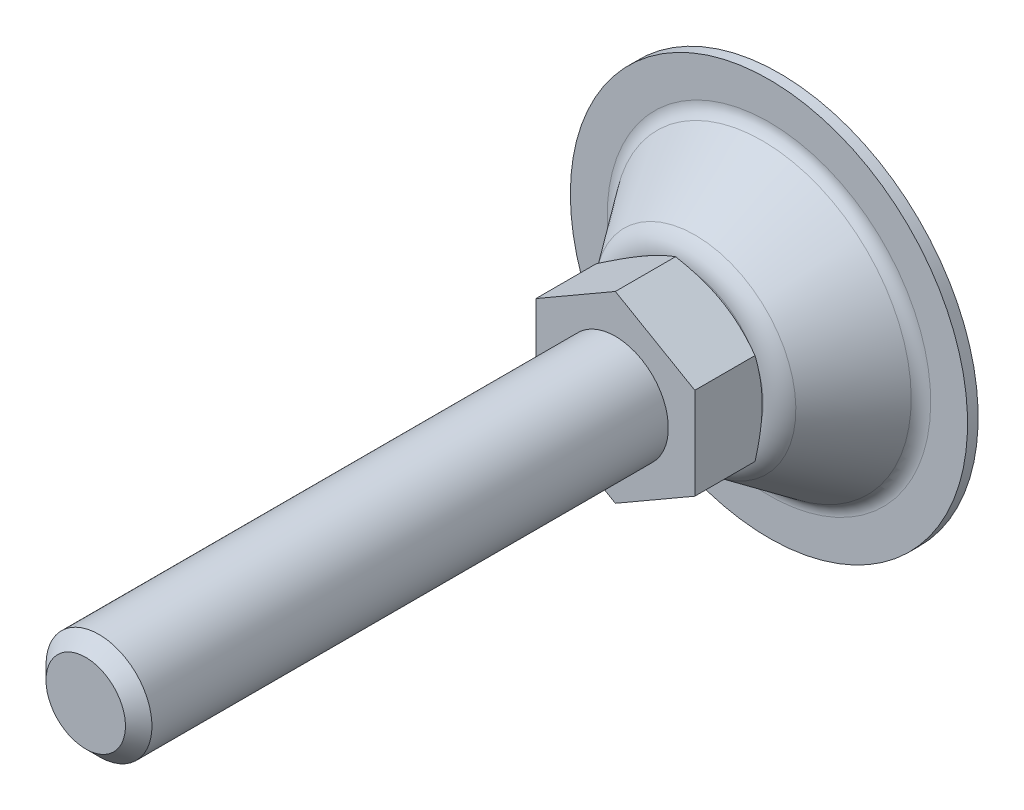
ISO-10303-21;
HEADER;
FILE_DESCRIPTION(('STEP AP214'),'2;1');
FILE_NAME('part.step','',(''),(''),'','','');
FILE_SCHEMA(('AUTOMOTIVE_DESIGN { 1 0 10303 214 1 1 1 1 }'));
ENDSEC;
DATA;
#1=APPLICATION_CONTEXT('core data for automotive mechanical design processes');
#2=APPLICATION_PROTOCOL_DEFINITION('international standard','automotive_design',2000,#1);
#3=PRODUCT_CONTEXT('',#1,'mechanical');
#4=PRODUCT('Part','Part','',(#3));
#5=PRODUCT_RELATED_PRODUCT_CATEGORY('part','',(#4));
#6=PRODUCT_DEFINITION_FORMATION('','',#4);
#7=PRODUCT_DEFINITION_CONTEXT('part definition',#1,'design');
#8=PRODUCT_DEFINITION('design','',#6,#7);
#9=PRODUCT_DEFINITION_SHAPE('','',#8);
#10=(LENGTH_UNIT() NAMED_UNIT(*) SI_UNIT(.MILLI.,.METRE.));
#11=(NAMED_UNIT(*) PLANE_ANGLE_UNIT() SI_UNIT($,.RADIAN.));
#12=(NAMED_UNIT(*) SI_UNIT($,.STERADIAN.) SOLID_ANGLE_UNIT());
#13=UNCERTAINTY_MEASURE_WITH_UNIT(LENGTH_MEASURE(1.E-05),#10,'distance_accuracy_value','');
#14=(GEOMETRIC_REPRESENTATION_CONTEXT(3) GLOBAL_UNCERTAINTY_ASSIGNED_CONTEXT((#13)) GLOBAL_UNIT_ASSIGNED_CONTEXT((#10,
#11,#12)) REPRESENTATION_CONTEXT('',''));
#15=CARTESIAN_POINT('',(0.,0.,0.));
#16=DIRECTION('',(0.,0.,1.));
#17=DIRECTION('',(1.,0.,0.));
#18=AXIS2_PLACEMENT_3D('',#15,#16,#17);
#19=CARTESIAN_POINT('',(0.,0.,31.));
#20=DIRECTION('',(0.,0.,1.));
#21=DIRECTION('',(0.5,-0.86602540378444,0.));
#22=AXIS2_PLACEMENT_3D('',#19,#20,#21);
#23=PLANE('',#22);
#24=DIRECTION('',(0.,1.,0.));
#25=VECTOR('',#24,1.);
#26=CARTESIAN_POINT('',(15.,-8.66025403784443,31.));
#27=LINE('',#26,#25);
#28=CARTESIAN_POINT('',(15.,-8.66025403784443,31.));
#29=VERTEX_POINT('',#28);
#30=CARTESIAN_POINT('',(15.,8.66025403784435,31.));
#31=VERTEX_POINT('',#30);
#32=EDGE_CURVE('E220',#29,#31,#27,.T.);
#33=ORIENTED_EDGE('',*,*,#32,.T.);
#34=DIRECTION('',(-0.866025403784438,0.5,0.));
#35=VECTOR('',#34,1.);
#36=CARTESIAN_POINT('',(15.,8.66025403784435,31.));
#37=LINE('',#36,#35);
#38=CARTESIAN_POINT('',(0.,17.3205080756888,31.));
#39=VERTEX_POINT('',#38);
#40=EDGE_CURVE('E266',#31,#39,#37,.T.);
#41=ORIENTED_EDGE('',*,*,#40,.T.);
#42=DIRECTION('',(-0.866025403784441,-0.5,0.));
#43=VECTOR('',#42,1.);
#44=CARTESIAN_POINT('',(0.,17.3205080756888,31.));
#45=LINE('',#44,#43);
#46=CARTESIAN_POINT('',(-15.,8.66025403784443,31.));
#47=VERTEX_POINT('',#46);
#48=EDGE_CURVE('E264',#39,#47,#45,.T.);
#49=ORIENTED_EDGE('',*,*,#48,.T.);
#50=DIRECTION('',(0.,-1.,0.));
#51=VECTOR('',#50,1.);
#52=CARTESIAN_POINT('',(-15.,8.66025403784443,31.));
#53=LINE('',#52,#51);
#54=CARTESIAN_POINT('',(-15.,-8.66025403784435,31.));
#55=VERTEX_POINT('',#54);
#56=EDGE_CURVE('E261',#47,#55,#53,.T.);
#57=ORIENTED_EDGE('',*,*,#56,.T.);
#58=DIRECTION('',(0.866025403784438,-0.5,0.));
#59=VECTOR('',#58,1.);
#60=CARTESIAN_POINT('',(-15.,-8.66025403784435,31.));
#61=LINE('',#60,#59);
#62=CARTESIAN_POINT('',(0.,-17.3205080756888,31.));
#63=VERTEX_POINT('',#62);
#64=EDGE_CURVE('E271',#55,#63,#61,.T.);
#65=ORIENTED_EDGE('',*,*,#64,.T.);
#66=DIRECTION('',(0.866025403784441,0.5,0.));
#67=VECTOR('',#66,1.);
#68=CARTESIAN_POINT('',(0.,-17.3205080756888,31.));
#69=LINE('',#68,#67);
#70=EDGE_CURVE('E37',#63,#29,#69,.T.);
#71=ORIENTED_EDGE('',*,*,#70,.T.);
#72=EDGE_LOOP('',(#33,#41,#49,#57,#65,#71));
#73=FACE_BOUND('',#72,.T.);
#74=CARTESIAN_POINT('',(0.,0.,31.));
#75=DIRECTION('',(0.,0.,1.));
#76=DIRECTION('',(0.5,-0.86602540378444,0.));
#77=AXIS2_PLACEMENT_3D('',#74,#75,#76);
#78=CIRCLE('',#77,10.);
#79=CARTESIAN_POINT('',(5.,-8.6602540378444,31.));
#80=VERTEX_POINT('',#79);
#81=EDGE_CURVE('E224',#80,#80,#78,.T.);
#82=ORIENTED_EDGE('',*,*,#81,.F.);
#83=EDGE_LOOP('',(#82));
#84=FACE_BOUND('',#83,.T.);
#85=ADVANCED_FACE('F14',(#73,#84),#23,.T.);
#86=CARTESIAN_POINT('',(-1.54390389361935E-13,2.67411998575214E-13,4.9999999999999));
#87=DIRECTION('',(0.,0.,1.));
#88=DIRECTION('',(0.5,-0.86602540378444,0.));
#89=AXIS2_PLACEMENT_3D('',#86,#87,#88);
#90=TOROIDAL_SURFACE('',#89,30.5382613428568,3.);
#91=CARTESIAN_POINT('',(-1.55741344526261E-13,2.69751921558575E-13,3.24909185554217));
#92=DIRECTION('',(0.,0.,1.));
#93=DIRECTION('',(0.5,-0.86602540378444,0.));
#94=AXIS2_PLACEMENT_3D('',#91,#92,#93);
#95=CIRCLE('',#94,28.1022152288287);
#96=CARTESIAN_POINT('',(14.0511076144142,-24.3372322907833,3.2490918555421));
#97=VERTEX_POINT('',#96);
#98=EDGE_CURVE('E73',#97,#97,#95,.T.);
#99=ORIENTED_EDGE('',*,*,#98,.F.);
#100=EDGE_LOOP('',(#99));
#101=FACE_BOUND('',#100,.T.);
#102=CARTESIAN_POINT('',(-1.57301461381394E-13,2.72454123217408E-13,1.99999999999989));
#103=DIRECTION('',(0.,0.,1.));
#104=DIRECTION('',(0.5,-0.86602540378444,0.));
#105=AXIS2_PLACEMENT_3D('',#102,#103,#104);
#106=CIRCLE('',#105,30.5382613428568);
#107=CARTESIAN_POINT('',(15.2691306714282,-26.446910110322,1.99999999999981));
#108=VERTEX_POINT('',#107);
#109=EDGE_CURVE('E102',#108,#108,#106,.T.);
#110=ORIENTED_EDGE('',*,*,#109,.T.);
#111=EDGE_LOOP('',(#110));
#112=FACE_BOUND('',#111,.T.);
#113=ADVANCED_FACE('F198',(#101,#112),#90,.F.);
#114=CARTESIAN_POINT('',(-1.55741344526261E-13,2.69751921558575E-13,3.24909185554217));
#115=DIRECTION('',(0.,0.,-1.));
#116=DIRECTION('',(-0.5,0.86602540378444,0.));
#117=AXIS2_PLACEMENT_3D('',#114,#115,#116);
#118=CONICAL_SURFACE('',#117,28.1022152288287,0.623199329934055);
#119=CARTESIAN_POINT('',(-1.39917641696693E-13,2.42344464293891E-13,15.9181802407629));
#120=DIRECTION('',(0.,0.,1.));
#121=DIRECTION('',(0.5,-0.86602540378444,0.));
#122=AXIS2_PLACEMENT_3D('',#119,#120,#121);
#123=CIRCLE('',#122,18.9963079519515);
#124=CARTESIAN_POINT('',(9.49815397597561,-16.4512852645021,15.9181802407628));
#125=VERTEX_POINT('',#124);
#126=EDGE_CURVE('E111',#125,#125,#123,.T.);
#127=ORIENTED_EDGE('',*,*,#126,.F.);
#128=EDGE_LOOP('',(#127));
#129=FACE_BOUND('',#128,.T.);
#130=ORIENTED_EDGE('',*,*,#98,.T.);
#131=EDGE_LOOP('',(#130));
#132=FACE_BOUND('',#131,.T.);
#133=ADVANCED_FACE('F195',(#129,#132),#118,.T.);
#134=CARTESIAN_POINT('',(-1.43982048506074E-13,2.49384223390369E-13,13.));
#135=DIRECTION('',(0.,0.,1.));
#136=DIRECTION('',(0.5,-0.86602540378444,0.));
#137=AXIS2_PLACEMENT_3D('',#134,#135,#136);
#138=TOROIDAL_SURFACE('',#137,14.9362310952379,5.);
#139=CARTESIAN_POINT('',(-1.43982048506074E-13,2.49384223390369E-13,18.));
#140=DIRECTION('',(0.,0.,1.));
#141=DIRECTION('',(0.5,-0.86602540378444,0.));
#142=AXIS2_PLACEMENT_3D('',#139,#140,#141);
#143=CIRCLE('',#142,14.9362310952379);
#144=CARTESIAN_POINT('',(7.46811554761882,-12.9351555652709,18.));
#145=VERTEX_POINT('',#144);
#146=EDGE_CURVE('E84',#145,#145,#143,.T.);
#147=ORIENTED_EDGE('',*,*,#146,.F.);
#148=EDGE_LOOP('',(#147));
#149=FACE_BOUND('',#148,.T.);
#150=ORIENTED_EDGE('',*,*,#126,.T.);
#151=EDGE_LOOP('',(#150));
#152=FACE_BOUND('',#151,.T.);
#153=ADVANCED_FACE('F191',(#149,#152),#138,.T.);
#154=CARTESIAN_POINT('',(-18.75,32.4759526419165,0.));
#155=DIRECTION('',(0.,0.,1.));
#156=DIRECTION('',(0.5,-0.86602540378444,0.));
#157=AXIS2_PLACEMENT_3D('',#154,#155,#156);
#158=PLANE('',#157);
#159=CARTESIAN_POINT('',(-1.59799463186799E-13,2.76780789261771E-13,-1.38777878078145E-13));
#160=DIRECTION('',(0.,0.,1.));
#161=DIRECTION('',(0.5,-0.86602540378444,0.));
#162=AXIS2_PLACEMENT_3D('',#159,#160,#161);
#163=CIRCLE('',#162,37.5);
#164=CARTESIAN_POINT('',(18.7499999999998,-32.4759526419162,-2.32452945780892E-13));
#165=VERTEX_POINT('',#164);
#166=EDGE_CURVE('E108',#165,#165,#163,.T.);
#167=ORIENTED_EDGE('',*,*,#166,.F.);
#168=EDGE_LOOP('',(#167));
#169=FACE_BOUND('',#168,.T.);
#170=ADVANCED_FACE('F187',(#169),#158,.F.);
#171=CARTESIAN_POINT('',(0.,0.,129.670029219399));
#172=DIRECTION('',(0.,0.,1.));
#173=DIRECTION('',(0.5,-0.86602540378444,0.));
#174=AXIS2_PLACEMENT_3D('',#171,#172,#173);
#175=CYLINDRICAL_SURFACE('',#174,37.5);
#176=CARTESIAN_POINT('',(-1.57301461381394E-13,2.72454123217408E-13,1.99999999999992));
#177=DIRECTION('',(0.,0.,1.));
#178=DIRECTION('',(0.5,-0.86602540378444,0.));
#179=AXIS2_PLACEMENT_3D('',#176,#177,#178);
#180=CIRCLE('',#179,37.5);
#181=CARTESIAN_POINT('',(18.7499999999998,-32.4759526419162,1.99999999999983));
#182=VERTEX_POINT('',#181);
#183=EDGE_CURVE('E105',#182,#182,#180,.T.);
#184=ORIENTED_EDGE('',*,*,#183,.F.);
#185=EDGE_LOOP('',(#184));
#186=FACE_BOUND('',#185,.T.);
#187=ORIENTED_EDGE('',*,*,#166,.T.);
#188=EDGE_LOOP('',(#187));
#189=FACE_BOUND('',#188,.T.);
#190=ADVANCED_FACE('F183',(#186,#189),#175,.T.);
#191=CARTESIAN_POINT('',(-18.75,32.4759526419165,2.));
#192=DIRECTION('',(0.,0.,-1.));
#193=DIRECTION('',(-0.5,0.86602540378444,0.));
#194=AXIS2_PLACEMENT_3D('',#191,#192,#193);
#195=PLANE('',#194);
#196=ORIENTED_EDGE('',*,*,#109,.F.);
#197=EDGE_LOOP('',(#196));
#198=FACE_BOUND('',#197,.T.);
#199=ORIENTED_EDGE('',*,*,#183,.T.);
#200=EDGE_LOOP('',(#199));
#201=FACE_BOUND('',#200,.T.);
#202=ADVANCED_FACE('F128',(#198,#201),#195,.F.);
#203=CARTESIAN_POINT('',(0.,0.,23.0943491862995));
#204=DIRECTION('',(0.,0.,1.));
#205=DIRECTION('',(0.5,-0.86602540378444,0.));
#206=AXIS2_PLACEMENT_3D('',#203,#204,#205);
#207=CONICAL_SURFACE('',#206,23.323671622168,1.0471975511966);
#208=CARTESIAN_POINT('',(0.,0.,18.));
#209=DIRECTION('',(0.,0.,-1.));
#210=DIRECTION('',(-0.5,0.86602540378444,0.));
#211=AXIS2_PLACEMENT_3D('',#208,#209,#210);
#212=CIRCLE('',#211,14.5);
#213=CARTESIAN_POINT('',(-7.25,12.5573683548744,18.));
#214=VERTEX_POINT('',#213);
#215=EDGE_CURVE('E226',#214,#214,#212,.T.);
#216=ORIENTED_EDGE('',*,*,#215,.F.);
#217=EDGE_LOOP('',(#216));
#218=FACE_BOUND('',#217,.T.);
#219=CARTESIAN_POINT('',(-12.7752963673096,-24.6963288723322,25.6816332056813));
#220=CARTESIAN_POINT('',(-12.4910694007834,-24.5322303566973,25.5220895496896));
#221=CARTESIAN_POINT('',(-12.206512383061,-24.3679412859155,25.3633302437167));
#222=CARTESIAN_POINT('',(-11.6366694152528,-24.0389422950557,25.0475576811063));
#223=CARTESIAN_POINT('',(-11.3513834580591,-23.8742323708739,24.8905444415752));
#224=CARTESIAN_POINT('',(-10.4942547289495,-23.3793688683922,24.4223494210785));
#225=CARTESIAN_POINT('',(-9.92122319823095,-23.0485289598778,24.1140585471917));
#226=CARTESIAN_POINT('',(-8.76831153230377,-22.3828950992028,23.5053939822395));
#227=CARTESIAN_POINT('',(-8.18841117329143,-22.0480894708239,23.2050712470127));
#228=CARTESIAN_POINT('',(-7.02404380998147,-21.3758416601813,22.6165131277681));
#229=CARTESIAN_POINT('',(-6.43957701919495,-21.0383996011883,22.3282771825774));
#230=CARTESIAN_POINT('',(-5.24579106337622,-20.3491669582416,21.7578369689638));
#231=CARTESIAN_POINT('',(-4.6362875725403,-19.9972699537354,21.4761443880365));
#232=CARTESIAN_POINT('',(-3.41019349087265,-19.2893842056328,20.9337181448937));
#233=CARTESIAN_POINT('',(-2.79360212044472,-18.9333950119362,20.6729868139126));
#234=CARTESIAN_POINT('',(-1.55348395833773,-18.2174124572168,20.1792225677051));
#235=CARTESIAN_POINT('',(-0.929973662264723,-17.8574286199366,19.9461348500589));
#236=CARTESIAN_POINT('',(0.326048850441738,-17.1322636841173,19.5150244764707));
#237=CARTESIAN_POINT('',(0.958558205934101,-16.7670842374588,19.3169909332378));
#238=CARTESIAN_POINT('',(1.91243675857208,-16.216362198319,19.0538662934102));
#239=CARTESIAN_POINT('',(2.2303543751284,-16.0328123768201,18.9719940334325));
#240=CARTESIAN_POINT('',(2.8683856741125,-15.6644448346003,18.8205188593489));
#241=CARTESIAN_POINT('',(3.18849931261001,-15.4796271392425,18.7509157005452));
#242=CARTESIAN_POINT('',(3.83071190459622,-15.1088455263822,18.6251978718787));
#243=CARTESIAN_POINT('',(4.15281082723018,-14.9228816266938,18.5690829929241));
#244=CARTESIAN_POINT('',(4.79866142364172,-14.5499996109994,18.4714557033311));
#245=CARTESIAN_POINT('',(5.12241302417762,-14.3630815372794,18.4299426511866));
#246=CARTESIAN_POINT('',(5.7668346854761,-13.9910245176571,18.3628722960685));
#247=CARTESIAN_POINT('',(6.08748870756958,-13.8058948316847,18.3371107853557));
#248=CARTESIAN_POINT('',(6.72945271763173,-13.4352567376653,18.3012764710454));
#249=CARTESIAN_POINT('',(7.05076269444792,-13.2497483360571,18.2912034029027));
#250=CARTESIAN_POINT('',(7.69346432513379,-12.878684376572,18.2869861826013));
#251=CARTESIAN_POINT('',(8.0148559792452,-12.6931288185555,18.2928420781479));
#252=CARTESIAN_POINT('',(8.65713622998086,-12.3223081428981,18.3203381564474));
#253=CARTESIAN_POINT('',(8.9780248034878,-12.1370430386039,18.3419790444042));
#254=CARTESIAN_POINT('',(9.74531187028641,-11.694049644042,18.4121345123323));
#255=CARTESIAN_POINT('',(10.1912229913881,-11.4366027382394,18.4678874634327));
#256=CARTESIAN_POINT('',(11.0798234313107,-10.9235690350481,18.6068735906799));
#257=CARTESIAN_POINT('',(11.5225123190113,-10.6679824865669,18.6901103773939));
#258=CARTESIAN_POINT('',(12.4042155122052,-10.158930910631,18.881103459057));
#259=CARTESIAN_POINT('',(12.84322676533,-9.90546764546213,18.988878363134));
#260=CARTESIAN_POINT('',(13.7168888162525,-9.40105862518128,19.2256508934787));
#261=CARTESIAN_POINT('',(14.151539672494,-9.15011283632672,19.3546482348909));
#262=CARTESIAN_POINT('',(15.0261682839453,-8.64514577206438,19.6338079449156));
#263=CARTESIAN_POINT('',(15.466047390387,-8.39118145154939,19.7843795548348));
#264=CARTESIAN_POINT('',(16.3414739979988,-7.8857536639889,20.1013827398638));
#265=CARTESIAN_POINT('',(16.7770214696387,-7.63429021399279,20.267814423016));
#266=CARTESIAN_POINT('',(17.6439961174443,-7.13374216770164,20.6138686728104));
#267=CARTESIAN_POINT('',(18.0754245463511,-6.88465684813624,20.7934870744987));
#268=CARTESIAN_POINT('',(18.9346884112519,-6.38856062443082,21.1637718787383));
#269=CARTESIAN_POINT('',(19.3625238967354,-6.14154969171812,21.3544381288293));
#270=CARTESIAN_POINT('',(20.4004383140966,-5.54230952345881,21.829942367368));
#271=CARTESIAN_POINT('',(21.0088362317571,-5.19105082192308,22.1196663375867));
#272=CARTESIAN_POINT('',(22.2202116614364,-4.49166289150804,22.7138939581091));
#273=CARTESIAN_POINT('',(22.8231887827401,-4.14353388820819,23.0183986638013));
#274=CARTESIAN_POINT('',(24.0247789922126,-3.44979545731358,23.6391170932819));
#275=CARTESIAN_POINT('',(24.6233909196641,-3.10418669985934,23.9553338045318));
#276=CARTESIAN_POINT('',(25.8168545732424,-2.41514013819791,24.5970218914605));
#277=CARTESIAN_POINT('',(26.4117063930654,-2.07170227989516,24.9224930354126));
#278=CARTESIAN_POINT('',(27.5990157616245,-1.38620889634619,25.5812970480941));
#279=CARTESIAN_POINT('',(28.1914695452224,-1.04415554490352,25.9146389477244));
#280=CARTESIAN_POINT('',(29.3737746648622,-0.36155136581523,26.5874202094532));
#281=CARTESIAN_POINT('',(29.9636259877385,-0.0210005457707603,26.9268596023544));
#282=CARTESIAN_POINT('',(31.1410545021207,0.658788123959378,27.6107079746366));
#283=CARTESIAN_POINT('',(31.728632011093,0.998026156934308,27.9551162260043));
#284=CARTESIAN_POINT('',(32.9019328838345,1.67543173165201,28.6481104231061));
#285=CARTESIAN_POINT('',(33.4876562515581,2.01359927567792,28.9966963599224));
#286=CARTESIAN_POINT('',(35.1389838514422,2.96699370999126,29.9857106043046));
#287=CARTESIAN_POINT('',(36.2027654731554,3.5811683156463,30.6301961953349));
#288=CARTESIAN_POINT('',(38.3264251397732,4.80726379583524,31.9277855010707));
#289=CARTESIAN_POINT('',(39.3863030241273,5.4191845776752,32.5808895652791));
#290=CARTESIAN_POINT('',(41.5001458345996,6.63961229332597,33.8918828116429));
#291=CARTESIAN_POINT('',(42.5541189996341,7.24812398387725,34.5497542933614));
#292=CARTESIAN_POINT('',(44.1332517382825,8.15983669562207,35.5403535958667));
#293=CARTESIAN_POINT('',(44.6593093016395,8.46355617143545,35.8711755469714));
#294=CARTESIAN_POINT('',(45.7108863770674,9.07068447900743,36.5339556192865));
#295=CARTESIAN_POINT('',(46.2364058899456,9.37409331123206,36.865913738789));
#296=CARTESIAN_POINT('',(46.7616874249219,9.67736474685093,37.1983733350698));
#297=B_SPLINE_CURVE_WITH_KNOTS('',3,(#219,#220,#221,#222,#223,#224,#225,#226,#227,#228,#229,
#230,#231,#232,#233,#234,#235,#236,#237,#238,#239,#240,#241,#242,#243,#244,#245,#246,#247,#248,
#249,#250,#251,#252,#253,#254,#255,#256,#257,#258,#259,#260,#261,#262,#263,#264,#265,#266,#267,
#268,#269,#270,#271,#272,#273,#274,#275,#276,#277,#278,#279,#280,#281,#282,#283,#284,#285,#286,
#287,#288,#289,#290,#291,#292,#293,#294,#295,#296),.UNSPECIFIED.,.F.,.F.,(4,2,2,2,2,2,2,2,2,2,2,
2,2,2,2,2,2,2,2,2,2,2,2,2,2,2,2,2,2,2,2,2,2,2,2,2,2,2,4),(0.,1.09476161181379,2.18953393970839,
4.37939496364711,6.58092776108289,8.7823582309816,11.0563262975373,13.3305469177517,
15.6001808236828,17.869108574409,18.9972925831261,20.1254540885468,21.2535981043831,
22.3816925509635,23.4948335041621,24.6079556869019,25.7210812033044,26.8342564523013,
28.3871111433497,29.9401699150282,31.4944104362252,33.0486300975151,34.6376511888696,
36.2266831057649,37.815215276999,39.4037255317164,41.6832356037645,43.9629086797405,
46.2431673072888,48.5233688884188,50.8063278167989,53.0892982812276,55.3719375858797,
57.6545720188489,61.8159896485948,65.9775765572,70.1279174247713,72.2029652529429,
74.2780099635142),.UNSPECIFIED.);
#298=CARTESIAN_POINT('',(0.,-17.3205080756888,19.6284210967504));
#299=VERTEX_POINT('',#298);
#300=CARTESIAN_POINT('',(15.,-8.66025403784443,19.6284210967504));
#301=VERTEX_POINT('',#300);
#302=EDGE_CURVE('E65',#299,#301,#297,.T.);
#303=ORIENTED_EDGE('',*,*,#302,.F.);
#304=CARTESIAN_POINT('',(-15.0002,-8.66013856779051,19.6284877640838));
#305=CARTESIAN_POINT('',(-14.6705058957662,-8.85048754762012,19.5185969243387));
#306=CARTESIAN_POINT('',(-14.3395258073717,-9.04157899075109,19.4136927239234));
#307=CARTESIAN_POINT('',(-13.674911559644,-9.42529420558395,19.2152437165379));
#308=CARTESIAN_POINT('',(-13.3412765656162,-9.61791845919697,19.1217026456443));
#309=CARTESIAN_POINT('',(-12.6707077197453,-10.0050715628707,18.9472372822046));
#310=CARTESIAN_POINT('',(-12.333767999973,-10.1996038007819,18.866342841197));
#311=CARTESIAN_POINT('',(-11.6575472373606,-10.5900200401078,18.7189077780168));
#312=CARTESIAN_POINT('',(-11.3182663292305,-10.7859039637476,18.6523663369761));
#313=CARTESIAN_POINT('',(-10.6460568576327,-11.1740042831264,18.5364675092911));
#314=CARTESIAN_POINT('',(-10.3131781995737,-11.3661918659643,18.4867265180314));
#315=CARTESIAN_POINT('',(-9.64589556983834,-11.7514476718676,18.4033218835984));
#316=CARTESIAN_POINT('',(-9.31149156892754,-11.9445159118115,18.3696585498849));
#317=CARTESIAN_POINT('',(-8.64212181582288,-12.3309767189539,18.3192592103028));
#318=CARTESIAN_POINT('',(-8.30715720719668,-12.5243686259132,18.3025030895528));
#319=CARTESIAN_POINT('',(-7.63691878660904,-12.9113309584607,18.2862785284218));
#320=CARTESIAN_POINT('',(-7.3016449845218,-13.104901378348,18.2868095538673));
#321=CARTESIAN_POINT('',(-6.67485311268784,-13.4667798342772,18.303951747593));
#322=CARTESIAN_POINT('',(-6.38329037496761,-13.6351136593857,18.3184719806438));
#323=CARTESIAN_POINT('',(-5.80083556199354,-13.971394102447,18.3603122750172));
#324=CARTESIAN_POINT('',(-5.50994353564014,-14.1393406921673,18.3876332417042));
#325=CARTESIAN_POINT('',(-4.9289881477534,-14.4747554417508,18.4545986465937));
#326=CARTESIAN_POINT('',(-4.63892567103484,-14.6422230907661,18.4942532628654));
#327=CARTESIAN_POINT('',(-4.06016058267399,-14.9763732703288,18.5851902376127));
#328=CARTESIAN_POINT('',(-3.77145806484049,-15.1430557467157,18.636473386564));
#329=CARTESIAN_POINT('',(-2.89508556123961,-15.6490296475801,18.8090619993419));
#330=CARTESIAN_POINT('',(-2.30995340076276,-15.9868558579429,18.9475763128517));
#331=CARTESIAN_POINT('',(-1.14841408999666,-16.657470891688,19.26194710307));
#332=CARTESIAN_POINT('',(-0.571992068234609,-16.9902683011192,19.4377297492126));
#333=CARTESIAN_POINT('',(0.000199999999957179,-17.3206235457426,19.6284877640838));
#334=B_SPLINE_CURVE_WITH_KNOTS('',3,(#304,#305,#306,#307,#308,#309,#310,#311,#312,#313,#314,
#315,#316,#317,#318,#319,#320,#321,#322,#323,#324,#325,#326,#327,#328,#329,#330,#331,#332,#333),
.UNSPECIFIED.,.F.,.F.,(4,2,2,2,2,2,2,2,2,2,2,2,2,2,4),(0.,1.18875411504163,2.37789802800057,
3.56980778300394,4.76164951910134,5.92407379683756,7.08652044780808,8.24758247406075,
9.40860862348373,10.4193068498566,11.4300765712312,12.4416826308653,13.4533574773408,
15.5211962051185,17.5849760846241),.UNSPECIFIED.);
#335=CARTESIAN_POINT('',(-15.,-8.66025403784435,19.6284210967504));
#336=VERTEX_POINT('',#335);
#337=EDGE_CURVE('E68',#336,#299,#334,.T.);
#338=ORIENTED_EDGE('',*,*,#337,.F.);
#339=CARTESIAN_POINT('',(-15.,8.66048497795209,19.6284877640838));
#340=CARTESIAN_POINT('',(-15.,8.27978701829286,19.5185969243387));
#341=CARTESIAN_POINT('',(-15.,7.89760413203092,19.4136927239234));
#342=CARTESIAN_POINT('',(-15.,7.1301737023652,19.2152437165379));
#343=CARTESIAN_POINT('',(-15.,6.74492519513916,19.1217026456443));
#344=CARTESIAN_POINT('',(-15.,5.97061898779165,18.9472372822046));
#345=CARTESIAN_POINT('',(-15.,5.58155451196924,18.866342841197));
#346=CARTESIAN_POINT('',(-15.,4.80072203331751,18.7189077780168));
#347=CARTESIAN_POINT('',(-15.,4.40895418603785,18.6523663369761));
#348=CARTESIAN_POINT('',(-15.,3.63275354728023,18.5364675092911));
#349=CARTESIAN_POINT('',(-15.,3.24837838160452,18.4867265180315));
#350=CARTESIAN_POINT('',(-15.,2.47786676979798,18.4033218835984));
#351=CARTESIAN_POINT('',(-15.,2.09173028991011,18.3696585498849));
#352=CARTESIAN_POINT('',(-15.,1.31880867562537,18.3192592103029));
#353=CARTESIAN_POINT('',(-15.,0.932024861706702,18.3025030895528));
#354=CARTESIAN_POINT('',(-15.,0.158100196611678,18.2862785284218));
#355=CARTESIAN_POINT('',(-15.,-0.229040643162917,18.2868095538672));
#356=CARTESIAN_POINT('',(-15.,-0.95279755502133,18.303951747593));
#357=CARTESIAN_POINT('',(-15.,-1.2894652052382,18.3184719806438));
#358=CARTESIAN_POINT('',(-15.,-1.96202609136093,18.3603122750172));
#359=CARTESIAN_POINT('',(-15.,-2.29791927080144,18.3876332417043));
#360=CARTESIAN_POINT('',(-15.,-2.96874876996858,18.4545986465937));
#361=CARTESIAN_POINT('',(-15.,-3.30368406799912,18.4942532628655));
#362=CARTESIAN_POINT('',(-15.,-3.97198442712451,18.5851902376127));
#363=CARTESIAN_POINT('',(-15.,-4.30534937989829,18.636473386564));
#364=CARTESIAN_POINT('',(-15.,-5.317297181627,18.8090619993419));
#365=CARTESIAN_POINT('',(-15.,-5.99294960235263,18.9475763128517));
#366=CARTESIAN_POINT('',(-15.,-7.33417966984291,19.26194710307));
#367=CARTESIAN_POINT('',(-15.,-7.99977448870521,19.4377297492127));
#368=CARTESIAN_POINT('',(-15.,-8.66048497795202,19.6284877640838));
#369=B_SPLINE_CURVE_WITH_KNOTS('',3,(#339,#340,#341,#342,#343,#344,#345,#346,#347,#348,#349,
#350,#351,#352,#353,#354,#355,#356,#357,#358,#359,#360,#361,#362,#363,#364,#365,#366,#367,#368),
.UNSPECIFIED.,.F.,.F.,(4,2,2,2,2,2,2,2,2,2,2,2,2,2,4),(0.,1.18875411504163,2.37789802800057,
3.56980778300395,4.76164951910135,5.92407379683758,7.08652044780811,8.24758247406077,
9.40860862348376,10.4193068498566,11.4300765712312,12.4416826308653,13.4533574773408,
15.5211962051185,17.5849760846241),.UNSPECIFIED.);
#370=CARTESIAN_POINT('',(-15.,8.66025403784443,19.6284210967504));
#371=VERTEX_POINT('',#370);
#372=EDGE_CURVE('E83',#371,#336,#369,.T.);
#373=ORIENTED_EDGE('',*,*,#372,.F.);
#374=CARTESIAN_POINT('',(-27.7752963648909,1.28443324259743,25.6816332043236));
#375=CARTESIAN_POINT('',(-27.4910693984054,1.44853175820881,25.5220895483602));
#376=CARTESIAN_POINT('',(-27.2065123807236,1.61282082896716,25.3633302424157));
#377=CARTESIAN_POINT('',(-26.6366694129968,1.94181981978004,25.0475576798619));
#378=CARTESIAN_POINT('',(-26.3513834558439,2.10652974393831,24.8905444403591));
#379=CARTESIAN_POINT('',(-25.4942547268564,2.60139324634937,24.4223494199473));
#380=CARTESIAN_POINT('',(-24.9212231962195,2.93223315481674,24.1140585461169));
#381=CARTESIAN_POINT('',(-23.7683115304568,3.59786701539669,23.5053939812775));
#382=CARTESIAN_POINT('',(-23.1884111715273,3.93267264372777,23.2050712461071));
#383=CARTESIAN_POINT('',(-22.0240438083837,4.60492045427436,22.6165131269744));
#384=CARTESIAN_POINT('',(-21.4395770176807,4.94236251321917,22.3282771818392));
#385=CARTESIAN_POINT('',(-20.2457910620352,5.63159515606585,21.7578369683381));
#386=CARTESIAN_POINT('',(-19.6362875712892,5.98349216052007,21.4761443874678));
#387=CARTESIAN_POINT('',(-18.4101934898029,6.69137790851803,20.9337181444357));
#388=CARTESIAN_POINT('',(-17.7936021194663,7.04736710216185,20.6729868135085));
#389=CARTESIAN_POINT('',(-16.5534839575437,7.76334965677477,20.1792225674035));
#390=CARTESIAN_POINT('',(-15.9299736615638,8.1233334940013,19.946134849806));
#391=CARTESIAN_POINT('',(-14.673951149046,8.84849842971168,19.5150244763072));
#392=CARTESIAN_POINT('',(-14.0414417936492,9.21367787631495,19.316990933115));
#393=CARTESIAN_POINT('',(-13.0875632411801,9.76439991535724,19.0538662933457));
#394=CARTESIAN_POINT('',(-12.769645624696,9.94794973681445,18.9719940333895));
#395=CARTESIAN_POINT('',(-12.1316143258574,10.3163172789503,18.8205188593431));
#396=CARTESIAN_POINT('',(-11.8115006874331,10.5011349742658,18.7509157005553));
#397=CARTESIAN_POINT('',(-11.1692880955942,10.871916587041,18.6251978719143));
#398=CARTESIAN_POINT('',(-10.8471891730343,11.0578804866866,18.5690829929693));
#399=CARTESIAN_POINT('',(-10.2013385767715,11.4307625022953,18.4714557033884));
#400=CARTESIAN_POINT('',(-9.87758697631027,11.6176805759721,18.4299426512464));
#401=CARTESIAN_POINT('',(-9.23316531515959,11.9897375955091,18.3628722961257));
#402=CARTESIAN_POINT('',(-8.91251129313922,12.1748672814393,18.337110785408));
#403=CARTESIAN_POINT('',(-8.27054728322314,12.5455053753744,18.3012764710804));
#404=CARTESIAN_POINT('',(-7.9492373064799,12.7310137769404,18.2912034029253));
#405=CARTESIAN_POINT('',(-7.3065356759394,13.1020777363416,18.2869861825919));
#406=CARTESIAN_POINT('',(-6.98514402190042,13.2876332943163,18.2928420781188));
#407=CARTESIAN_POINT('',(-6.34286377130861,13.6584539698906,18.3203381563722));
#408=CARTESIAN_POINT('',(-6.02197519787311,13.8437190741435,18.3419790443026));
#409=CARTESIAN_POINT('',(-5.25468813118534,14.2867124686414,18.4121345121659));
#410=CARTESIAN_POINT('',(-4.80877701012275,14.5441593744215,18.4678874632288));
#411=CARTESIAN_POINT('',(-3.92017657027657,15.0571930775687,18.6068735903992));
#412=CARTESIAN_POINT('',(-3.47748768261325,15.3127796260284,18.6901103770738));
#413=CARTESIAN_POINT('',(-2.59578448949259,15.821831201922,18.8811034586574));
#414=CARTESIAN_POINT('',(-2.15677323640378,16.0752944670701,18.9888783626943));
#415=CARTESIAN_POINT('',(-1.28311118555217,16.57970348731,19.2256508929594));
#416=CARTESIAN_POINT('',(-0.84846032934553,16.8306492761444,19.3546482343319));
#417=CARTESIAN_POINT('',(0.0261682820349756,17.3356163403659,19.6338079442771));
#418=CARTESIAN_POINT('',(0.466047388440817,17.5895806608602,19.7843795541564));
#419=CARTESIAN_POINT('',(1.34147399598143,18.0950084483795,20.1013827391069));
#420=CARTESIAN_POINT('',(1.7770214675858,18.3464718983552,20.2678144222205));
#421=CARTESIAN_POINT('',(2.64399611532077,18.8470199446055,20.6138686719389));
#422=CARTESIAN_POINT('',(3.07542454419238,19.0961052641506,20.7934870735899));
#423=CARTESIAN_POINT('',(3.93468840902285,19.5922014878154,21.1637718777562));
#424=CARTESIAN_POINT('',(4.36252389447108,19.8392124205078,21.3544381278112));
#425=CARTESIAN_POINT('',(5.40043831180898,20.4384525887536,21.8299423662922));
#426=CARTESIAN_POINT('',(6.0088362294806,20.7897112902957,22.1196663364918));
#427=CARTESIAN_POINT('',(7.22021165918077,21.4890992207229,22.7138939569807));
#428=CARTESIAN_POINT('',(7.82318878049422,21.8372282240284,23.0183986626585));
#429=CARTESIAN_POINT('',(9.0247789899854,22.5309666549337,23.639117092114));
#430=CARTESIAN_POINT('',(9.62339091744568,22.876575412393,23.955333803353));
#431=CARTESIAN_POINT('',(10.8168545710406,23.5656219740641,24.5970218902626));
#432=CARTESIAN_POINT('',(11.4117063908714,23.9090598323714,24.9224930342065));
#433=CARTESIAN_POINT('',(12.5990157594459,24.5945532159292,25.5812970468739));
#434=CARTESIAN_POINT('',(13.1914695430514,24.9366065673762,25.9146389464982));
#435=CARTESIAN_POINT('',(14.3737746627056,25.6192107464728,26.5874202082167));
#436=CARTESIAN_POINT('',(14.9636259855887,25.9597615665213,26.9268596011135));
#437=CARTESIAN_POINT('',(16.1410544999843,26.6395502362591,27.6107079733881));
#438=CARTESIAN_POINT('',(16.728632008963,26.9787882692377,27.9551162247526));
#439=CARTESIAN_POINT('',(17.9019328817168,27.6561938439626,28.6481104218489));
#440=CARTESIAN_POINT('',(18.4876562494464,27.9943613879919,28.996696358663));
#441=CARTESIAN_POINT('',(20.1389838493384,28.9477558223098,29.9857106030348));
#442=CARTESIAN_POINT('',(21.202765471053,29.5619304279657,30.6301961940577));
#443=CARTESIAN_POINT('',(23.3264251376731,30.788025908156,31.9277854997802));
#444=CARTESIAN_POINT('',(24.386303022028,31.3999466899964,32.5808895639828));
#445=CARTESIAN_POINT('',(26.5001458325,32.620374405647,33.8918828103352));
#446=CARTESIAN_POINT('',(27.5541189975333,33.2288860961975,34.549754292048));
#447=CARTESIAN_POINT('',(29.1332517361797,34.1405988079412,35.5403535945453));
#448=CARTESIAN_POINT('',(29.6593092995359,34.4443182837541,35.8711755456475));
#449=CARTESIAN_POINT('',(30.7108863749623,35.0514465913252,36.5339556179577));
#450=CARTESIAN_POINT('',(31.2364058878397,35.3548554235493,36.8659137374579));
#451=CARTESIAN_POINT('',(31.7616874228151,35.6581268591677,37.1983733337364));
#452=B_SPLINE_CURVE_WITH_KNOTS('',3,(#374,#375,#376,#377,#378,#379,#380,#381,#382,#383,#384,
#385,#386,#387,#388,#389,#390,#391,#392,#393,#394,#395,#396,#397,#398,#399,#400,#401,#402,#403,
#404,#405,#406,#407,#408,#409,#410,#411,#412,#413,#414,#415,#416,#417,#418,#419,#420,#421,#422,
#423,#424,#425,#426,#427,#428,#429,#430,#431,#432,#433,#434,#435,#436,#437,#438,#439,#440,#441,
#442,#443,#444,#445,#446,#447,#448,#449,#450,#451),.UNSPECIFIED.,.F.,.F.,(4,2,2,2,2,2,2,2,2,2,2,
2,2,2,2,2,2,2,2,2,2,2,2,2,2,2,2,2,2,2,2,2,2,2,2,2,2,2,4),(0.,1.09476161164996,2.18953393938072,
4.37939496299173,6.58092776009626,8.78235822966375,11.0563262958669,13.3305469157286,
15.6001808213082,17.8691085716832,18.9972925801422,20.1254540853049,21.2535981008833,
22.3816925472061,23.4948335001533,24.6079556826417,25.7210811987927,26.834256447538,
28.3871111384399,29.9401699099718,31.494410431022,33.0486300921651,34.6376511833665,
36.2266831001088,37.8152152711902,39.403725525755,41.6832355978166,43.9629086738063,
46.2431673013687,48.5233688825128,50.8063278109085,53.0892982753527,55.3719375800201,
57.6545720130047,61.8159896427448,65.9775765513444,70.1279174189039,72.2029652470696,
74.278009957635),.UNSPECIFIED.);
#453=CARTESIAN_POINT('',(0.,17.3205080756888,19.6284210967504));
#454=VERTEX_POINT('',#453);
#455=EDGE_CURVE('E149',#454,#371,#452,.F.);
#456=ORIENTED_EDGE('',*,*,#455,.F.);
#457=CARTESIAN_POINT('',(15.0002,8.66013856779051,19.6284877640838));
#458=CARTESIAN_POINT('',(14.6705058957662,8.85048754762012,19.5185969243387));
#459=CARTESIAN_POINT('',(14.3395258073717,9.04157899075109,19.4136927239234));
#460=CARTESIAN_POINT('',(13.674911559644,9.42529420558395,19.2152437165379));
#461=CARTESIAN_POINT('',(13.3412765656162,9.61791845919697,19.1217026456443));
#462=CARTESIAN_POINT('',(12.6707077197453,10.0050715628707,18.9472372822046));
#463=CARTESIAN_POINT('',(12.333767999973,10.1996038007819,18.866342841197));
#464=CARTESIAN_POINT('',(11.6575472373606,10.5900200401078,18.7189077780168));
#465=CARTESIAN_POINT('',(11.3182663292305,10.7859039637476,18.6523663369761));
#466=CARTESIAN_POINT('',(10.6460568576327,11.1740042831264,18.5364675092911));
#467=CARTESIAN_POINT('',(10.3131781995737,11.3661918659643,18.4867265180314));
#468=CARTESIAN_POINT('',(9.64589556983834,11.7514476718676,18.4033218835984));
#469=CARTESIAN_POINT('',(9.31149156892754,11.9445159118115,18.3696585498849));
#470=CARTESIAN_POINT('',(8.64212181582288,12.3309767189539,18.3192592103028));
#471=CARTESIAN_POINT('',(8.30715720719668,12.5243686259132,18.3025030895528));
#472=CARTESIAN_POINT('',(7.63691878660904,12.9113309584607,18.2862785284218));
#473=CARTESIAN_POINT('',(7.3016449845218,13.104901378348,18.2868095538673));
#474=CARTESIAN_POINT('',(6.67485311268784,13.4667798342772,18.303951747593));
#475=CARTESIAN_POINT('',(6.38329037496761,13.6351136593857,18.3184719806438));
#476=CARTESIAN_POINT('',(5.80083556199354,13.971394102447,18.3603122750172));
#477=CARTESIAN_POINT('',(5.50994353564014,14.1393406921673,18.3876332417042));
#478=CARTESIAN_POINT('',(4.9289881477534,14.4747554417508,18.4545986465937));
#479=CARTESIAN_POINT('',(4.63892567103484,14.6422230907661,18.4942532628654));
#480=CARTESIAN_POINT('',(4.06016058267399,14.9763732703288,18.5851902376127));
#481=CARTESIAN_POINT('',(3.77145806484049,15.1430557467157,18.636473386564));
#482=CARTESIAN_POINT('',(2.89508556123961,15.6490296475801,18.8090619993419));
#483=CARTESIAN_POINT('',(2.30995340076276,15.9868558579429,18.9475763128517));
#484=CARTESIAN_POINT('',(1.14841408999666,16.657470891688,19.26194710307));
#485=CARTESIAN_POINT('',(0.571992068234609,16.9902683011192,19.4377297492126));
#486=CARTESIAN_POINT('',(-0.000199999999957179,17.3206235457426,19.6284877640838));
#487=B_SPLINE_CURVE_WITH_KNOTS('',3,(#457,#458,#459,#460,#461,#462,#463,#464,#465,#466,#467,
#468,#469,#470,#471,#472,#473,#474,#475,#476,#477,#478,#479,#480,#481,#482,#483,#484,#485,#486),
.UNSPECIFIED.,.F.,.F.,(4,2,2,2,2,2,2,2,2,2,2,2,2,2,4),(0.,1.18875411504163,2.37789802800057,
3.56980778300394,4.76164951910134,5.92407379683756,7.08652044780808,8.24758247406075,
9.40860862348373,10.4193068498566,11.4300765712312,12.4416826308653,13.4533574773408,
15.5211962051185,17.5849760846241),.UNSPECIFIED.);
#488=CARTESIAN_POINT('',(15.,8.66025403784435,19.6284210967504));
#489=VERTEX_POINT('',#488);
#490=EDGE_CURVE('E156',#489,#454,#487,.T.);
#491=ORIENTED_EDGE('',*,*,#490,.F.);
#492=CARTESIAN_POINT('',(15.,-8.66048497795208,19.6284877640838));
#493=CARTESIAN_POINT('',(15.,-8.27978701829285,19.5185969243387));
#494=CARTESIAN_POINT('',(15.,-7.89760413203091,19.4136927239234));
#495=CARTESIAN_POINT('',(15.,-7.13017370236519,19.2152437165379));
#496=CARTESIAN_POINT('',(15.,-6.74492519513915,19.1217026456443));
#497=CARTESIAN_POINT('',(15.,-5.97061898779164,18.9472372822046));
#498=CARTESIAN_POINT('',(15.,-5.58155451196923,18.866342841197));
#499=CARTESIAN_POINT('',(15.,-4.8007220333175,18.7189077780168));
#500=CARTESIAN_POINT('',(15.,-4.40895418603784,18.6523663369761));
#501=CARTESIAN_POINT('',(15.,-3.63275354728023,18.5364675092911));
#502=CARTESIAN_POINT('',(15.,-3.24837838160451,18.4867265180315));
#503=CARTESIAN_POINT('',(15.,-2.47786676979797,18.4033218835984));
#504=CARTESIAN_POINT('',(15.,-2.0917302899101,18.3696585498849));
#505=CARTESIAN_POINT('',(15.,-1.31880867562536,18.3192592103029));
#506=CARTESIAN_POINT('',(15.,-0.932024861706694,18.3025030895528));
#507=CARTESIAN_POINT('',(15.,-0.158100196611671,18.2862785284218));
#508=CARTESIAN_POINT('',(15.,0.229040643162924,18.2868095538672));
#509=CARTESIAN_POINT('',(15.,0.952797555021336,18.303951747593));
#510=CARTESIAN_POINT('',(15.,1.28946520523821,18.3184719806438));
#511=CARTESIAN_POINT('',(15.,1.96202609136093,18.3603122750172));
#512=CARTESIAN_POINT('',(15.,2.29791927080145,18.3876332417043));
#513=CARTESIAN_POINT('',(15.,2.96874876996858,18.4545986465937));
#514=CARTESIAN_POINT('',(15.,3.30368406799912,18.4942532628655));
#515=CARTESIAN_POINT('',(15.,3.97198442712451,18.5851902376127));
#516=CARTESIAN_POINT('',(15.,4.30534937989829,18.636473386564));
#517=CARTESIAN_POINT('',(15.,5.317297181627,18.8090619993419));
#518=CARTESIAN_POINT('',(15.,5.99294960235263,18.9475763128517));
#519=CARTESIAN_POINT('',(15.,7.33417966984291,19.26194710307));
#520=CARTESIAN_POINT('',(15.,7.99977448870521,19.4377297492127));
#521=CARTESIAN_POINT('',(15.,8.66048497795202,19.6284877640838));
#522=B_SPLINE_CURVE_WITH_KNOTS('',3,(#492,#493,#494,#495,#496,#497,#498,#499,#500,#501,#502,
#503,#504,#505,#506,#507,#508,#509,#510,#511,#512,#513,#514,#515,#516,#517,#518,#519,#520,#521),
.UNSPECIFIED.,.F.,.F.,(4,2,2,2,2,2,2,2,2,2,2,2,2,2,4),(0.,1.18875411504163,2.37789802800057,
3.56980778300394,4.76164951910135,5.92407379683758,7.08652044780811,8.24758247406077,
9.40860862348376,10.4193068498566,11.4300765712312,12.4416826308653,13.4533574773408,
15.5211962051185,17.584976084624),.UNSPECIFIED.);
#523=EDGE_CURVE('E29',#301,#489,#522,.T.);
#524=ORIENTED_EDGE('',*,*,#523,.F.);
#525=EDGE_LOOP('',(#303,#338,#373,#456,#491,#524));
#526=FACE_BOUND('',#525,.T.);
#527=ADVANCED_FACE('F67',(#218,#526),#207,.T.);
#528=CARTESIAN_POINT('',(12.5573683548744,7.25,18.));
#529=DIRECTION('',(0.,0.,-1.));
#530=DIRECTION('',(-0.5,0.86602540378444,0.));
#531=AXIS2_PLACEMENT_3D('',#528,#529,#530);
#532=PLANE('',#531);
#533=ORIENTED_EDGE('',*,*,#146,.T.);
#534=EDGE_LOOP('',(#533));
#535=FACE_BOUND('',#534,.T.);
#536=ORIENTED_EDGE('',*,*,#215,.T.);
#537=EDGE_LOOP('',(#536));
#538=FACE_BOUND('',#537,.T.);
#539=ADVANCED_FACE('F127',(#535,#538),#532,.F.);
#540=CARTESIAN_POINT('',(0.,-17.3205080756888,31.));
#541=DIRECTION('',(-0.5,0.866025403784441,0.));
#542=DIRECTION('',(-0.866025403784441,-0.5,0.));
#543=AXIS2_PLACEMENT_3D('',#540,#541,#542);
#544=PLANE('',#543);
#545=DIRECTION('',(0.,0.,-1.));
#546=VECTOR('',#545,1.);
#547=CARTESIAN_POINT('',(0.,-17.3205080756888,31.));
#548=LINE('',#547,#546);
#549=EDGE_CURVE('E80',#63,#299,#548,.T.);
#550=ORIENTED_EDGE('',*,*,#549,.T.);
#551=ORIENTED_EDGE('',*,*,#302,.T.);
#552=DIRECTION('',(0.,0.,-1.));
#553=VECTOR('',#552,1.);
#554=CARTESIAN_POINT('',(15.,-8.66025403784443,31.));
#555=LINE('',#554,#553);
#556=EDGE_CURVE('E87',#29,#301,#555,.T.);
#557=ORIENTED_EDGE('',*,*,#556,.F.);
#558=ORIENTED_EDGE('',*,*,#70,.F.);
#559=EDGE_LOOP('',(#550,#551,#557,#558));
#560=FACE_BOUND('',#559,.T.);
#561=ADVANCED_FACE('F86',(#560),#544,.F.);
#562=CARTESIAN_POINT('',(-15.,-8.66025403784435,31.));
#563=DIRECTION('',(0.5,0.866025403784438,0.));
#564=DIRECTION('',(-0.866025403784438,0.5,0.));
#565=AXIS2_PLACEMENT_3D('',#562,#563,#564);
#566=PLANE('',#565);
#567=DIRECTION('',(0.,0.,-1.));
#568=VECTOR('',#567,1.);
#569=CARTESIAN_POINT('',(-15.,-8.66025403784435,31.));
#570=LINE('',#569,#568);
#571=EDGE_CURVE('E82',#55,#336,#570,.T.);
#572=ORIENTED_EDGE('',*,*,#571,.T.);
#573=ORIENTED_EDGE('',*,*,#337,.T.);
#574=ORIENTED_EDGE('',*,*,#549,.F.);
#575=ORIENTED_EDGE('',*,*,#64,.F.);
#576=EDGE_LOOP('',(#572,#573,#574,#575));
#577=FACE_BOUND('',#576,.T.);
#578=ADVANCED_FACE('F78',(#577),#566,.F.);
#579=CARTESIAN_POINT('',(-15.,8.66025403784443,31.));
#580=DIRECTION('',(1.,0.,0.));
#581=DIRECTION('',(0.,1.,0.));
#582=AXIS2_PLACEMENT_3D('',#579,#580,#581);
#583=PLANE('',#582);
#584=DIRECTION('',(0.,0.,-1.));
#585=VECTOR('',#584,1.);
#586=CARTESIAN_POINT('',(-15.,8.66025403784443,31.));
#587=LINE('',#586,#585);
#588=EDGE_CURVE('E89',#47,#371,#587,.T.);
#589=ORIENTED_EDGE('',*,*,#588,.T.);
#590=ORIENTED_EDGE('',*,*,#372,.T.);
#591=ORIENTED_EDGE('',*,*,#571,.F.);
#592=ORIENTED_EDGE('',*,*,#56,.F.);
#593=EDGE_LOOP('',(#589,#590,#591,#592));
#594=FACE_BOUND('',#593,.T.);
#595=ADVANCED_FACE('F246',(#594),#583,.F.);
#596=CARTESIAN_POINT('',(0.,17.3205080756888,31.));
#597=DIRECTION('',(0.5,-0.866025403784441,0.));
#598=DIRECTION('',(0.866025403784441,0.5,0.));
#599=AXIS2_PLACEMENT_3D('',#596,#597,#598);
#600=PLANE('',#599);
#601=DIRECTION('',(0.,0.,-1.));
#602=VECTOR('',#601,1.);
#603=CARTESIAN_POINT('',(0.,17.3205080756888,31.));
#604=LINE('',#603,#602);
#605=EDGE_CURVE('E96',#39,#454,#604,.T.);
#606=ORIENTED_EDGE('',*,*,#605,.T.);
#607=ORIENTED_EDGE('',*,*,#455,.T.);
#608=ORIENTED_EDGE('',*,*,#588,.F.);
#609=ORIENTED_EDGE('',*,*,#48,.F.);
#610=EDGE_LOOP('',(#606,#607,#608,#609));
#611=FACE_BOUND('',#610,.T.);
#612=ADVANCED_FACE('F173',(#611),#600,.F.);
#613=CARTESIAN_POINT('',(15.,8.66025403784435,31.));
#614=DIRECTION('',(-0.5,-0.866025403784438,0.));
#615=DIRECTION('',(0.866025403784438,-0.5,0.));
#616=AXIS2_PLACEMENT_3D('',#613,#614,#615);
#617=PLANE('',#616);
#618=DIRECTION('',(0.,0.,-1.));
#619=VECTOR('',#618,1.);
#620=CARTESIAN_POINT('',(15.,8.66025403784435,31.));
#621=LINE('',#620,#619);
#622=EDGE_CURVE('E99',#31,#489,#621,.T.);
#623=ORIENTED_EDGE('',*,*,#622,.T.);
#624=ORIENTED_EDGE('',*,*,#490,.T.);
#625=ORIENTED_EDGE('',*,*,#605,.F.);
#626=ORIENTED_EDGE('',*,*,#40,.F.);
#627=EDGE_LOOP('',(#623,#624,#625,#626));
#628=FACE_BOUND('',#627,.T.);
#629=ADVANCED_FACE('F169',(#628),#617,.F.);
#630=CARTESIAN_POINT('',(15.,-8.66025403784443,31.));
#631=DIRECTION('',(-1.,0.,0.));
#632=DIRECTION('',(0.,-1.,0.));
#633=AXIS2_PLACEMENT_3D('',#630,#631,#632);
#634=PLANE('',#633);
#635=ORIENTED_EDGE('',*,*,#556,.T.);
#636=ORIENTED_EDGE('',*,*,#523,.T.);
#637=ORIENTED_EDGE('',*,*,#622,.F.);
#638=ORIENTED_EDGE('',*,*,#32,.F.);
#639=EDGE_LOOP('',(#635,#636,#637,#638));
#640=FACE_BOUND('',#639,.T.);
#641=ADVANCED_FACE('F172',(#640),#634,.F.);
#642=CARTESIAN_POINT('',(0.,0.,131.));
#643=DIRECTION('',(0.,0.,-1.));
#644=DIRECTION('',(-0.5,0.86602540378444,0.));
#645=AXIS2_PLACEMENT_3D('',#642,#643,#644);
#646=CYLINDRICAL_SURFACE('',#645,10.);
#647=CARTESIAN_POINT('',(0.,0.,128.5));
#648=DIRECTION('',(0.,0.,1.));
#649=DIRECTION('',(0.5,-0.86602540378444,0.));
#650=AXIS2_PLACEMENT_3D('',#647,#648,#649);
#651=CIRCLE('',#650,10.);
#652=CARTESIAN_POINT('',(5.,-8.6602540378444,128.5));
#653=VERTEX_POINT('',#652);
#654=EDGE_CURVE('E9',#653,#653,#651,.F.);
#655=ORIENTED_EDGE('',*,*,#654,.T.);
#656=EDGE_LOOP('',(#655));
#657=FACE_BOUND('',#656,.T.);
#658=ORIENTED_EDGE('',*,*,#81,.T.);
#659=EDGE_LOOP('',(#658));
#660=FACE_BOUND('',#659,.T.);
#661=ADVANCED_FACE('F179',(#657,#660),#646,.T.);
#662=CARTESIAN_POINT('',(0.,0.,131.));
#663=DIRECTION('',(0.,0.,1.));
#664=DIRECTION('',(0.5,-0.86602540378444,0.));
#665=AXIS2_PLACEMENT_3D('',#662,#663,#664);
#666=PLANE('',#665);
#667=CARTESIAN_POINT('',(0.,0.,131.));
#668=DIRECTION('',(0.,0.,1.));
#669=DIRECTION('',(0.5,-0.86602540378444,0.));
#670=AXIS2_PLACEMENT_3D('',#667,#668,#669);
#671=CIRCLE('',#670,7.5);
#672=CARTESIAN_POINT('',(3.75,-6.4951905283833,131.));
#673=VERTEX_POINT('',#672);
#674=EDGE_CURVE('E22',#673,#673,#671,.T.);
#675=ORIENTED_EDGE('',*,*,#674,.T.);
#676=EDGE_LOOP('',(#675));
#677=FACE_BOUND('',#676,.T.);
#678=ADVANCED_FACE('F297',(#677),#666,.T.);
#679=CARTESIAN_POINT('',(0.,0.,131.));
#680=DIRECTION('',(0.,0.,-1.));
#681=DIRECTION('',(-0.5,0.86602540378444,0.));
#682=AXIS2_PLACEMENT_3D('',#679,#680,#681);
#683=CONICAL_SURFACE('',#682,7.5,0.785398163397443);
#684=ORIENTED_EDGE('',*,*,#654,.F.);
#685=EDGE_LOOP('',(#684));
#686=FACE_BOUND('',#685,.T.);
#687=ORIENTED_EDGE('',*,*,#674,.F.);
#688=EDGE_LOOP('',(#687));
#689=FACE_BOUND('',#688,.T.);
#690=ADVANCED_FACE('F16',(#686,#689),#683,.T.);
#691=CLOSED_SHELL('',(#85,#113,#133,#153,#170,#190,#202,#527,#539,#561,#578,#595,#612,#629,#641,
#661,#678,#690));
#692=MANIFOLD_SOLID_BREP('B1',#691);
#693=ADVANCED_BREP_SHAPE_REPRESENTATION('',(#18,#692),#14);
#694=SHAPE_DEFINITION_REPRESENTATION(#9,#693);
ENDSEC;
END-ISO-10303-21;
